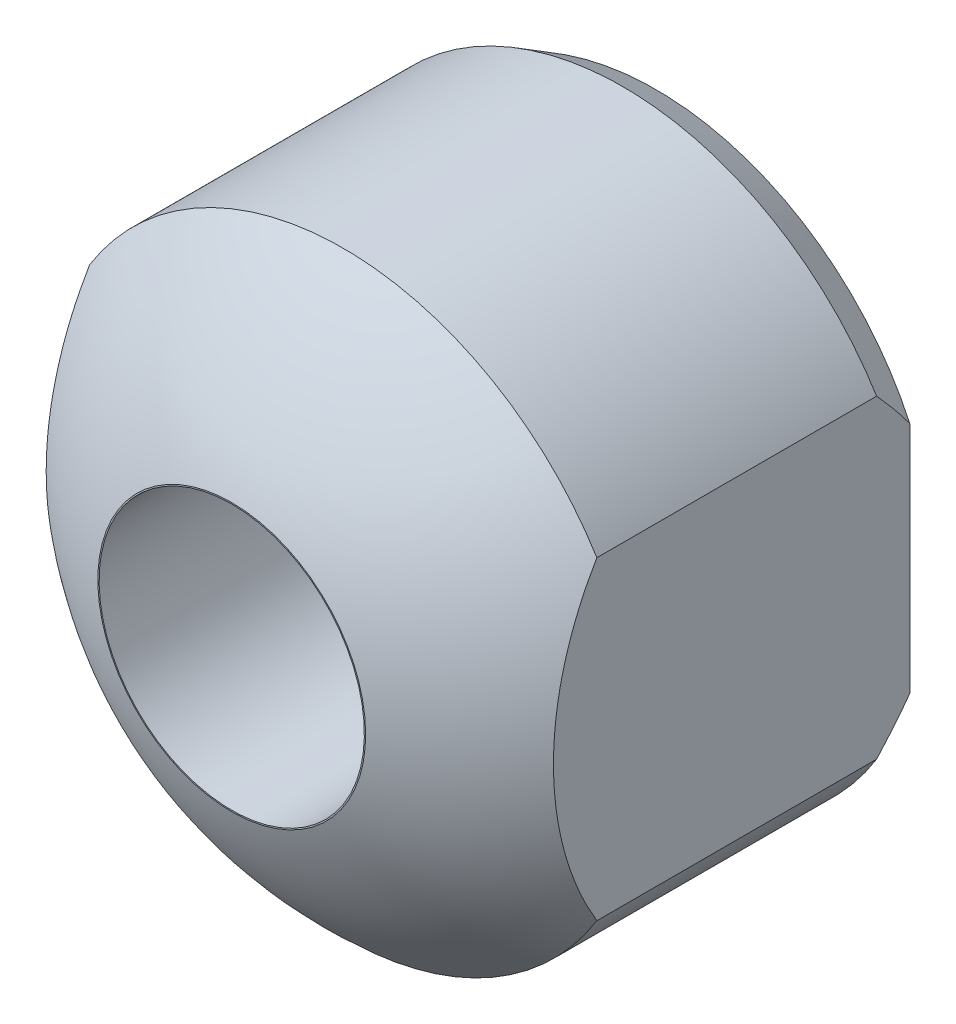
ISO-10303-21;
HEADER;
FILE_DESCRIPTION(('STEP AP214'),'2;1');
FILE_NAME('part.step','',(''),(''),'','','');
FILE_SCHEMA(('AUTOMOTIVE_DESIGN { 1 0 10303 214 1 1 1 1 }'));
ENDSEC;
DATA;
#1=APPLICATION_CONTEXT('core data for automotive mechanical design processes');
#2=APPLICATION_PROTOCOL_DEFINITION('international standard','automotive_design',2000,#1);
#3=PRODUCT_CONTEXT('',#1,'mechanical');
#4=PRODUCT('Part','Part','',(#3));
#5=PRODUCT_RELATED_PRODUCT_CATEGORY('part','',(#4));
#6=PRODUCT_DEFINITION_FORMATION('','',#4);
#7=PRODUCT_DEFINITION_CONTEXT('part definition',#1,'design');
#8=PRODUCT_DEFINITION('design','',#6,#7);
#9=PRODUCT_DEFINITION_SHAPE('','',#8);
#10=(LENGTH_UNIT() NAMED_UNIT(*) SI_UNIT(.MILLI.,.METRE.));
#11=(NAMED_UNIT(*) PLANE_ANGLE_UNIT() SI_UNIT($,.RADIAN.));
#12=(NAMED_UNIT(*) SI_UNIT($,.STERADIAN.) SOLID_ANGLE_UNIT());
#13=UNCERTAINTY_MEASURE_WITH_UNIT(LENGTH_MEASURE(1.E-05),#10,'distance_accuracy_value','');
#14=(GEOMETRIC_REPRESENTATION_CONTEXT(3) GLOBAL_UNCERTAINTY_ASSIGNED_CONTEXT((#13)) GLOBAL_UNIT_ASSIGNED_CONTEXT((#10,
#11,#12)) REPRESENTATION_CONTEXT('',''));
#15=CARTESIAN_POINT('',(0.,0.,0.));
#16=DIRECTION('',(0.,0.,1.));
#17=DIRECTION('',(1.,0.,0.));
#18=AXIS2_PLACEMENT_3D('',#15,#16,#17);
#19=CARTESIAN_POINT('',(-3.16240089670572E-12,0.,1.50000000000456));
#20=DIRECTION('',(0.,0.,1.));
#21=DIRECTION('',(-1.,0.,0.));
#22=AXIS2_PLACEMENT_3D('',#19,#20,#21);
#23=SPHERICAL_SURFACE('',#22,11.9999999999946);
#24=CARTESIAN_POINT('',(0.,0.,12.8));
#25=DIRECTION('',(0.,0.,1.));
#26=DIRECTION('',(0.,1.,0.));
#27=AXIS2_PLACEMENT_3D('',#24,#25,#26);
#28=CIRCLE('',#27,4.0385641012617);
#29=CARTESIAN_POINT('',(0.,4.0385641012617,12.8));
#30=VERTEX_POINT('',#29);
#31=EDGE_CURVE('E9',#30,#30,#28,.T.);
#32=ORIENTED_EDGE('',*,*,#31,.F.);
#33=EDGE_LOOP('',(#32));
#34=FACE_BOUND('',#33,.T.);
#35=CARTESIAN_POINT('',(7.65,0.,1.50000000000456));
#36=DIRECTION('',(-1.,0.,0.));
#37=DIRECTION('',(0.,-1.,0.));
#38=AXIS2_PLACEMENT_3D('',#35,#36,#37);
#39=CIRCLE('',#38,9.2454042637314);
#40=CARTESIAN_POINT('',(7.65,4.74104418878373,9.4372539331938));
#41=VERTEX_POINT('',#40);
#42=CARTESIAN_POINT('',(7.65,-4.74104418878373,9.4372539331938));
#43=VERTEX_POINT('',#42);
#44=EDGE_CURVE('E104',#41,#43,#39,.F.);
#45=ORIENTED_EDGE('',*,*,#44,.F.);
#46=CARTESIAN_POINT('',(0.,0.,9.4372539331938));
#47=DIRECTION('',(0.,0.,1.));
#48=DIRECTION('',(0.,1.,0.));
#49=AXIS2_PLACEMENT_3D('',#46,#47,#48);
#50=CIRCLE('',#49,9.);
#51=CARTESIAN_POINT('',(-7.65,4.74104418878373,9.4372539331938));
#52=VERTEX_POINT('',#51);
#53=EDGE_CURVE('E99',#41,#52,#50,.T.);
#54=ORIENTED_EDGE('',*,*,#53,.T.);
#55=CARTESIAN_POINT('',(-7.65,0.,1.50000000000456));
#56=DIRECTION('',(1.,0.,0.));
#57=DIRECTION('',(0.,1.,0.));
#58=AXIS2_PLACEMENT_3D('',#55,#56,#57);
#59=CIRCLE('',#58,9.24540426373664);
#60=CARTESIAN_POINT('',(-7.65,-4.74104418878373,9.4372539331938));
#61=VERTEX_POINT('',#60);
#62=EDGE_CURVE('E92',#61,#52,#59,.F.);
#63=ORIENTED_EDGE('',*,*,#62,.F.);
#64=EDGE_CURVE('E22',#61,#43,#50,.T.);
#65=ORIENTED_EDGE('',*,*,#64,.T.);
#66=EDGE_LOOP('',(#45,#54,#63,#65));
#67=FACE_BOUND('',#66,.T.);
#68=ADVANCED_FACE('F14',(#34,#67),#23,.T.);
#69=CARTESIAN_POINT('',(0.,0.,0.));
#70=DIRECTION('',(0.,0.,1.));
#71=DIRECTION('',(0.,1.,0.));
#72=AXIS2_PLACEMENT_3D('',#69,#70,#71);
#73=CYLINDRICAL_SURFACE('',#72,9.);
#74=ORIENTED_EDGE('',*,*,#53,.F.);
#75=DIRECTION('',(0.,0.,1.));
#76=VECTOR('',#75,1.);
#77=CARTESIAN_POINT('',(7.65,4.74104418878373,0.));
#78=LINE('',#77,#76);
#79=CARTESIAN_POINT('',(7.65,4.74104418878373,1.));
#80=VERTEX_POINT('',#79);
#81=EDGE_CURVE('E77',#41,#80,#78,.F.);
#82=ORIENTED_EDGE('',*,*,#81,.T.);
#83=CARTESIAN_POINT('',(0.,0.,1.));
#84=DIRECTION('',(0.,0.,1.));
#85=DIRECTION('',(0.,1.,0.));
#86=AXIS2_PLACEMENT_3D('',#83,#84,#85);
#87=CIRCLE('',#86,9.);
#88=CARTESIAN_POINT('',(-7.65,4.74104418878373,1.));
#89=VERTEX_POINT('',#88);
#90=EDGE_CURVE('E85',#80,#89,#87,.T.);
#91=ORIENTED_EDGE('',*,*,#90,.T.);
#92=DIRECTION('',(0.,0.,1.));
#93=VECTOR('',#92,1.);
#94=CARTESIAN_POINT('',(-7.65,4.74104418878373,0.));
#95=LINE('',#94,#93);
#96=EDGE_CURVE('E109',#89,#52,#95,.T.);
#97=ORIENTED_EDGE('',*,*,#96,.T.);
#98=EDGE_LOOP('',(#74,#82,#91,#97));
#99=FACE_BOUND('',#98,.T.);
#100=ADVANCED_FACE('F110',(#99),#73,.T.);
#101=CARTESIAN_POINT('',(0.,0.,1.));
#102=DIRECTION('',(0.,0.,1.));
#103=DIRECTION('',(0.,1.,0.));
#104=AXIS2_PLACEMENT_3D('',#101,#102,#103);
#105=CONICAL_SURFACE('',#104,9.,0.523598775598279);
#106=ORIENTED_EDGE('',*,*,#90,.F.);
#107=CARTESIAN_POINT('',(7.65,9.42253132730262,6.43343108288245));
#108=CARTESIAN_POINT('',(7.65,9.26459441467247,6.22107932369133));
#109=CARTESIAN_POINT('',(7.65,9.105659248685,6.00946402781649));
#110=CARTESIAN_POINT('',(7.65,8.78547000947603,5.58797021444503));
#111=CARTESIAN_POINT('',(7.65,8.62421575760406,5.37809183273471));
#112=CARTESIAN_POINT('',(7.65,8.29877391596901,4.95996216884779));
#113=CARTESIAN_POINT('',(7.65,8.13458122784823,4.75171484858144));
#114=CARTESIAN_POINT('',(7.65,7.80318382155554,4.337635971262));
#115=CARTESIAN_POINT('',(7.65,7.63597917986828,4.13180435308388));
#116=CARTESIAN_POINT('',(7.65,7.29712178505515,3.72184297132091));
#117=CARTESIAN_POINT('',(7.65,7.12544904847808,3.51772969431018));
#118=CARTESIAN_POINT('',(7.65,6.77801179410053,3.11301794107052));
#119=CARTESIAN_POINT('',(7.65,6.60224740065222,2.91241935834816));
#120=CARTESIAN_POINT('',(7.65,6.24604509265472,2.51566372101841));
#121=CARTESIAN_POINT('',(7.65,6.06561062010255,2.31950358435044));
#122=CARTESIAN_POINT('',(7.65,5.6991017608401,1.93254196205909));
#123=CARTESIAN_POINT('',(7.65,5.51302803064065,1.74173985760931));
#124=CARTESIAN_POINT('',(7.65,5.17174466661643,1.40409645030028));
#125=CARTESIAN_POINT('',(7.65,5.01773591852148,1.25604377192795));
#126=CARTESIAN_POINT('',(7.65,4.70472636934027,0.965271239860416));
#127=CARTESIAN_POINT('',(7.65,4.54572528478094,0.822551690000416));
#128=CARTESIAN_POINT('',(7.65,4.22147979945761,0.543317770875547));
#129=CARTESIAN_POINT('',(7.65,4.05621765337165,0.406823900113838));
#130=CARTESIAN_POINT('',(7.65,3.71904801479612,0.142247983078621));
#131=CARTESIAN_POINT('',(7.65,3.54714051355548,0.0141659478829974));
#132=CARTESIAN_POINT('',(7.65,3.19265334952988,-0.233448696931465));
#133=CARTESIAN_POINT('',(7.65,3.00993857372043,-0.352789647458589));
#134=CARTESIAN_POINT('',(7.65,2.63574467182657,-0.577156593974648));
#135=CARTESIAN_POINT('',(7.65,2.44426315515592,-0.682178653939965));
#136=CARTESIAN_POINT('',(7.65,2.05335497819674,-0.873083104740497));
#137=CARTESIAN_POINT('',(7.65,1.85398591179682,-0.959081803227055));
#138=CARTESIAN_POINT('',(7.65,1.44676520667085,-1.10778159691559));
#139=CARTESIAN_POINT('',(7.65,1.23892389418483,-1.17051016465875));
#140=CARTESIAN_POINT('',(7.65,0.901111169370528,-1.24844246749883));
#141=CARTESIAN_POINT('',(7.65,0.77318041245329,-1.2726215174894));
#142=CARTESIAN_POINT('',(7.65,0.515743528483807,-1.31004599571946));
#143=CARTESIAN_POINT('',(7.65,0.386237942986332,-1.32329508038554));
#144=CARTESIAN_POINT('',(7.65,0.126564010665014,-1.33836163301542));
#145=CARTESIAN_POINT('',(7.65,-0.00360431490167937,-1.34017946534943));
#146=CARTESIAN_POINT('',(7.65,-0.263594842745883,-1.33231683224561));
#147=CARTESIAN_POINT('',(7.65,-0.393417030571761,-1.32263589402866));
#148=CARTESIAN_POINT('',(7.65,-0.651217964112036,-1.29220443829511));
#149=CARTESIAN_POINT('',(7.65,-0.779202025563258,-1.27149861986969));
#150=CARTESIAN_POINT('',(7.65,-1.03308919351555,-1.21977936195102));
#151=CARTESIAN_POINT('',(7.65,-1.15899140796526,-1.18876161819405));
#152=CARTESIAN_POINT('',(7.65,-1.53283906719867,-1.081596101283));
#153=CARTESIAN_POINT('',(7.65,-1.77680912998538,-0.991351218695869));
#154=CARTESIAN_POINT('',(7.65,-2.22586360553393,-0.793366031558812));
#155=CARTESIAN_POINT('',(7.65,-2.4323004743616,-0.688571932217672));
#156=CARTESIAN_POINT('',(7.65,-2.83535439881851,-0.461309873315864));
#157=CARTESIAN_POINT('',(7.65,-3.03196241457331,-0.338826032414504));
#158=CARTESIAN_POINT('',(7.65,-3.41682302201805,-0.0799505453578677));
#159=CARTESIAN_POINT('',(7.65,-3.60503906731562,0.0564947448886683));
#160=CARTESIAN_POINT('',(7.65,-3.97338703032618,0.339680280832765));
#161=CARTESIAN_POINT('',(7.65,-4.15352177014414,0.486416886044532));
#162=CARTESIAN_POINT('',(7.65,-4.52217214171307,0.800950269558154));
#163=CARTESIAN_POINT('',(7.65,-4.71006699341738,0.969471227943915));
#164=CARTESIAN_POINT('',(7.65,-4.98594182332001,1.22699792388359));
#165=CARTESIAN_POINT('',(7.65,-5.07652438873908,1.31324584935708));
#166=CARTESIAN_POINT('',(7.65,-5.25611862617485,1.48734006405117));
#167=CARTESIAN_POINT('',(7.65,-5.34513049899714,1.57518614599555));
#168=CARTESIAN_POINT('',(7.65,-5.43343108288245,1.66374319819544));
#169=B_SPLINE_CURVE_WITH_KNOTS('',3,(#107,#108,#109,#110,#111,#112,#113,#114,#115,#116,#117,
#118,#119,#120,#121,#122,#123,#124,#125,#126,#127,#128,#129,#130,#131,#132,#133,#134,#135,#136,
#137,#138,#139,#140,#141,#142,#143,#144,#145,#146,#147,#148,#149,#150,#151,#152,#153,#154,#155,
#156,#157,#158,#159,#160,#161,#162,#163,#164,#165,#166,#167,#168),.UNSPECIFIED.,.F.,.F.,(4,2,2,
2,2,2,2,2,2,2,2,2,2,2,2,2,2,2,2,2,2,2,2,2,2,2,2,2,2,2,4),(0.,0.793941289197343,1.58794407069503,
2.38349223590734,3.17902022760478,3.97910206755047,4.77915962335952,5.57864342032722,
6.37803449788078,7.01882668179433,7.65965531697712,8.30246065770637,8.94526684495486,
9.59946089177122,10.2538344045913,10.9040891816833,11.5535738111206,11.9437502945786,
12.3337961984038,12.7238296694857,13.1138791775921,13.5023591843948,13.8910015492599,
14.6686345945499,15.3621974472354,16.0563868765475,16.7533515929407,17.450070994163,
18.2069927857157,18.582204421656,18.9573677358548),.UNSPECIFIED.);
#170=CARTESIAN_POINT('',(7.65,3.5239932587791,0.));
#171=VERTEX_POINT('',#170);
#172=EDGE_CURVE('E69',#80,#171,#169,.T.);
#173=ORIENTED_EDGE('',*,*,#172,.T.);
#174=CARTESIAN_POINT('',(0.,0.,0.));
#175=DIRECTION('',(0.,0.,1.));
#176=DIRECTION('',(0.,1.,0.));
#177=AXIS2_PLACEMENT_3D('',#174,#175,#176);
#178=CIRCLE('',#177,8.4226497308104);
#179=CARTESIAN_POINT('',(-7.65,3.52399325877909,0.));
#180=VERTEX_POINT('',#179);
#181=EDGE_CURVE('E83',#171,#180,#178,.T.);
#182=ORIENTED_EDGE('',*,*,#181,.T.);
#183=CARTESIAN_POINT('',(-7.65,-5.43343108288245,1.66374319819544));
#184=CARTESIAN_POINT('',(-7.65,-5.33180749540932,1.5618317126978));
#185=CARTESIAN_POINT('',(-7.65,-5.22924110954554,1.46085013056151));
#186=CARTESIAN_POINT('',(-7.65,-5.02199570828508,1.26103732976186));
#187=CARTESIAN_POINT('',(-7.65,-4.9173162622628,1.1622065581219));
#188=CARTESIAN_POINT('',(-7.65,-4.70519491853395,0.966599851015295));
#189=CARTESIAN_POINT('',(-7.65,-4.59774291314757,0.869834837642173));
#190=CARTESIAN_POINT('',(-7.65,-4.38029435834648,0.679224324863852));
#191=CARTESIAN_POINT('',(-7.65,-4.27029795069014,0.585378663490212));
#192=CARTESIAN_POINT('',(-7.65,-3.9298810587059,0.303740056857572));
#193=CARTESIAN_POINT('',(-7.65,-3.69491845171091,0.121356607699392));
#194=CARTESIAN_POINT('',(-7.65,-3.21108453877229,-0.223391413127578));
#195=CARTESIAN_POINT('',(-7.65,-2.96224019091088,-0.385792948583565));
#196=CARTESIAN_POINT('',(-7.65,-2.57789643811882,-0.607718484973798));
#197=CARTESIAN_POINT('',(-7.65,-2.44850188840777,-0.677831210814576));
#198=CARTESIAN_POINT('',(-7.65,-2.18554588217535,-0.809858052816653));
#199=CARTESIAN_POINT('',(-7.65,-2.05198410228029,-0.871771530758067));
#200=CARTESIAN_POINT('',(-7.65,-1.78154787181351,-0.985591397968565));
#201=CARTESIAN_POINT('',(-7.65,-1.64469728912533,-1.03755405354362));
#202=CARTESIAN_POINT('',(-7.65,-1.3672851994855,-1.13035984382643));
#203=CARTESIAN_POINT('',(-7.65,-1.22672480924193,-1.17120628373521));
#204=CARTESIAN_POINT('',(-7.65,-0.940138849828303,-1.24088283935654));
#205=CARTESIAN_POINT('',(-7.65,-0.794061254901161,-1.26950161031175));
#206=CARTESIAN_POINT('',(-7.65,-0.499804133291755,-1.31244605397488));
#207=CARTESIAN_POINT('',(-7.65,-0.351624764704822,-1.32677279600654));
#208=CARTESIAN_POINT('',(-7.65,-0.0545835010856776,-1.34042624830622));
#209=CARTESIAN_POINT('',(-7.65,0.0942783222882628,-1.33975449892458));
#210=CARTESIAN_POINT('',(-7.65,0.391169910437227,-1.32344698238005));
#211=CARTESIAN_POINT('',(-7.65,0.539199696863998,-1.30781160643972));
#212=CARTESIAN_POINT('',(-7.65,0.812007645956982,-1.2656071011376));
#213=CARTESIAN_POINT('',(-7.65,0.937083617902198,-1.24092131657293));
#214=CARTESIAN_POINT('',(-7.65,1.18496753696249,-1.18194112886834));
#215=CARTESIAN_POINT('',(-7.65,1.30777466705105,-1.14764333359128));
#216=CARTESIAN_POINT('',(-7.65,1.67206409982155,-1.03175694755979));
#217=CARTESIAN_POINT('',(-7.65,1.90946078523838,-0.93716758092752));
#218=CARTESIAN_POINT('',(-7.65,2.36077045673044,-0.726579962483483));
#219=CARTESIAN_POINT('',(-7.65,2.57526198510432,-0.611778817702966));
#220=CARTESIAN_POINT('',(-7.65,2.99359602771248,-0.363955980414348));
#221=CARTESIAN_POINT('',(-7.65,3.19742821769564,-0.230917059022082));
#222=CARTESIAN_POINT('',(-7.65,3.59723628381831,0.0500779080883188));
#223=CARTESIAN_POINT('',(-7.65,3.79312218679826,0.198160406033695));
#224=CARTESIAN_POINT('',(-7.65,4.17631694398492,0.504782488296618));
#225=CARTESIAN_POINT('',(-7.65,4.36362949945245,0.663317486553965));
#226=CARTESIAN_POINT('',(-7.65,4.78558515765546,1.03674480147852));
#227=CARTESIAN_POINT('',(-7.65,5.01777412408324,1.25439773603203));
#228=CARTESIAN_POINT('',(-7.65,5.47241083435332,1.69969987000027));
#229=CARTESIAN_POINT('',(-7.65,5.69485543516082,1.92735224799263));
#230=CARTESIAN_POINT('',(-7.65,6.13215934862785,2.39058111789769));
#231=CARTESIAN_POINT('',(-7.65,6.34700409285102,2.62617129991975));
#232=CARTESIAN_POINT('',(-7.65,6.77012798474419,3.10318096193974));
#233=CARTESIAN_POINT('',(-7.65,6.97840667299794,3.34460084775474));
#234=CARTESIAN_POINT('',(-7.65,7.37893217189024,3.8194993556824));
#235=CARTESIAN_POINT('',(-7.65,7.57145262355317,4.0527479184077));
#236=CARTESIAN_POINT('',(-7.65,7.95234498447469,4.52262060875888));
#237=CARTESIAN_POINT('',(-7.65,8.14071669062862,4.75924490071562));
#238=CARTESIAN_POINT('',(-7.65,8.51306135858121,5.23417333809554));
#239=CARTESIAN_POINT('',(-7.65,8.69705053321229,5.47246480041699));
#240=CARTESIAN_POINT('',(-7.65,9.06196463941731,5.95133321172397));
#241=CARTESIAN_POINT('',(-7.65,9.24288998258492,6.19190984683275));
#242=CARTESIAN_POINT('',(-7.65,9.42253132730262,6.43343108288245));
#243=B_SPLINE_CURVE_WITH_KNOTS('',3,(#183,#184,#185,#186,#187,#188,#189,#190,#191,#192,#193,
#194,#195,#196,#197,#198,#199,#200,#201,#202,#203,#204,#205,#206,#207,#208,#209,#210,#211,#212,
#213,#214,#215,#216,#217,#218,#219,#220,#221,#222,#223,#224,#225,#226,#227,#228,#229,#230,#231,
#232,#233,#234,#235,#236,#237,#238,#239,#240,#241,#242),.UNSPECIFIED.,.F.,.F.,(4,2,2,2,2,2,2,2,
2,2,2,2,2,2,2,2,2,2,2,2,2,2,2,2,2,2,2,2,2,4),(0.,0.431767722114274,0.863624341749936,
1.29737632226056,1.73110419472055,2.62271200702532,3.51264484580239,3.95392042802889,
4.39523033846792,4.8339660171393,5.27257110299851,5.71847730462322,6.1643501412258,
6.61017718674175,7.05599257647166,7.43805375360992,7.82024993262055,8.58450271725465,
9.31329195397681,10.0427744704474,10.7789960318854,11.5148966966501,12.4692292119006,
13.4238673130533,14.3802458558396,15.3366911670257,16.2439514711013,17.1512560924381,
18.0543991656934,18.9574199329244),.UNSPECIFIED.);
#244=EDGE_CURVE('E111',#180,#89,#243,.T.);
#245=ORIENTED_EDGE('',*,*,#244,.T.);
#246=EDGE_LOOP('',(#106,#173,#182,#245));
#247=FACE_BOUND('',#246,.T.);
#248=ADVANCED_FACE('F81',(#247),#105,.T.);
#249=CARTESIAN_POINT('',(-8.4226497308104,0.,0.));
#250=DIRECTION('',(0.,0.,-1.));
#251=DIRECTION('',(0.,-1.,0.));
#252=AXIS2_PLACEMENT_3D('',#249,#250,#251);
#253=PLANE('',#252);
#254=CARTESIAN_POINT('',(0.,0.,0.));
#255=DIRECTION('',(0.,0.,1.));
#256=DIRECTION('',(0.,1.,0.));
#257=AXIS2_PLACEMENT_3D('',#254,#255,#256);
#258=CIRCLE('',#257,4.);
#259=CARTESIAN_POINT('',(0.,4.,0.));
#260=VERTEX_POINT('',#259);
#261=EDGE_CURVE('E162',#260,#260,#258,.T.);
#262=ORIENTED_EDGE('',*,*,#261,.T.);
#263=EDGE_LOOP('',(#262));
#264=FACE_BOUND('',#263,.T.);
#265=ORIENTED_EDGE('',*,*,#181,.F.);
#266=DIRECTION('',(0.,1.,0.));
#267=VECTOR('',#266,1.);
#268=CARTESIAN_POINT('',(7.65,-9.,0.));
#269=LINE('',#268,#267);
#270=CARTESIAN_POINT('',(7.65,-3.5239932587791,0.));
#271=VERTEX_POINT('',#270);
#272=EDGE_CURVE('E65',#271,#171,#269,.T.);
#273=ORIENTED_EDGE('',*,*,#272,.F.);
#274=CARTESIAN_POINT('',(-7.65,-3.52399325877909,0.));
#275=VERTEX_POINT('',#274);
#276=EDGE_CURVE('E91',#275,#271,#178,.T.);
#277=ORIENTED_EDGE('',*,*,#276,.F.);
#278=DIRECTION('',(0.,1.,0.));
#279=VECTOR('',#278,1.);
#280=CARTESIAN_POINT('',(-7.65,-9.,0.));
#281=LINE('',#280,#279);
#282=EDGE_CURVE('E89',#275,#180,#281,.T.);
#283=ORIENTED_EDGE('',*,*,#282,.T.);
#284=EDGE_LOOP('',(#265,#273,#277,#283));
#285=FACE_BOUND('',#284,.T.);
#286=ADVANCED_FACE('F88',(#264,#285),#253,.T.);
#287=DIRECTION('',(0.,0.,1.));
#288=VECTOR('',#287,1.);
#289=CARTESIAN_POINT('',(7.65,-4.74104418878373,0.));
#290=LINE('',#289,#288);
#291=CARTESIAN_POINT('',(7.65,-4.74104418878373,1.));
#292=VERTEX_POINT('',#291);
#293=EDGE_CURVE('E182',#43,#292,#290,.F.);
#294=ORIENTED_EDGE('',*,*,#293,.F.);
#295=ORIENTED_EDGE('',*,*,#64,.F.);
#296=DIRECTION('',(0.,0.,1.));
#297=VECTOR('',#296,1.);
#298=CARTESIAN_POINT('',(-7.65,-4.74104418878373,0.));
#299=LINE('',#298,#297);
#300=CARTESIAN_POINT('',(-7.65,-4.74104418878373,1.));
#301=VERTEX_POINT('',#300);
#302=EDGE_CURVE('E29',#301,#61,#299,.T.);
#303=ORIENTED_EDGE('',*,*,#302,.F.);
#304=EDGE_CURVE('E97',#301,#292,#87,.T.);
#305=ORIENTED_EDGE('',*,*,#304,.T.);
#306=EDGE_LOOP('',(#294,#295,#303,#305));
#307=FACE_BOUND('',#306,.T.);
#308=ADVANCED_FACE('F136',(#307),#73,.T.);
#309=CARTESIAN_POINT('',(7.65,-9.42253132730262,6.43343108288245));
#310=CARTESIAN_POINT('',(7.65,-9.26459441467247,6.22107932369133));
#311=CARTESIAN_POINT('',(7.65,-9.105659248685,6.00946402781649));
#312=CARTESIAN_POINT('',(7.65,-8.78547000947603,5.58797021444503));
#313=CARTESIAN_POINT('',(7.65,-8.62421575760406,5.37809183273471));
#314=CARTESIAN_POINT('',(7.65,-8.29877391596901,4.95996216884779));
#315=CARTESIAN_POINT('',(7.65,-8.13458122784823,4.75171484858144));
#316=CARTESIAN_POINT('',(7.65,-7.80318382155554,4.337635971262));
#317=CARTESIAN_POINT('',(7.65,-7.63597917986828,4.13180435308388));
#318=CARTESIAN_POINT('',(7.65,-7.29712178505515,3.72184297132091));
#319=CARTESIAN_POINT('',(7.65,-7.12544904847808,3.51772969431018));
#320=CARTESIAN_POINT('',(7.65,-6.77801179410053,3.11301794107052));
#321=CARTESIAN_POINT('',(7.65,-6.60224740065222,2.91241935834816));
#322=CARTESIAN_POINT('',(7.65,-6.24604509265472,2.51566372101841));
#323=CARTESIAN_POINT('',(7.65,-6.06561062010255,2.31950358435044));
#324=CARTESIAN_POINT('',(7.65,-5.6991017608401,1.93254196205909));
#325=CARTESIAN_POINT('',(7.65,-5.51302803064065,1.74173985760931));
#326=CARTESIAN_POINT('',(7.65,-5.17174466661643,1.40409645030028));
#327=CARTESIAN_POINT('',(7.65,-5.01773591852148,1.25604377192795));
#328=CARTESIAN_POINT('',(7.65,-4.70472636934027,0.965271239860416));
#329=CARTESIAN_POINT('',(7.65,-4.54572528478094,0.822551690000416));
#330=CARTESIAN_POINT('',(7.65,-4.22147979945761,0.543317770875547));
#331=CARTESIAN_POINT('',(7.65,-4.05621765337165,0.406823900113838));
#332=CARTESIAN_POINT('',(7.65,-3.71904801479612,0.142247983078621));
#333=CARTESIAN_POINT('',(7.65,-3.54714051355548,0.0141659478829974));
#334=CARTESIAN_POINT('',(7.65,-3.19265334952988,-0.233448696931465));
#335=CARTESIAN_POINT('',(7.65,-3.00993857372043,-0.352789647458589));
#336=CARTESIAN_POINT('',(7.65,-2.63574467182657,-0.577156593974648));
#337=CARTESIAN_POINT('',(7.65,-2.44426315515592,-0.682178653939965));
#338=CARTESIAN_POINT('',(7.65,-2.05335497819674,-0.873083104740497));
#339=CARTESIAN_POINT('',(7.65,-1.85398591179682,-0.959081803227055));
#340=CARTESIAN_POINT('',(7.65,-1.44676520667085,-1.10778159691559));
#341=CARTESIAN_POINT('',(7.65,-1.23892389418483,-1.17051016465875));
#342=CARTESIAN_POINT('',(7.65,-0.901111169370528,-1.24844246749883));
#343=CARTESIAN_POINT('',(7.65,-0.77318041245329,-1.2726215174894));
#344=CARTESIAN_POINT('',(7.65,-0.515743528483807,-1.31004599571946));
#345=CARTESIAN_POINT('',(7.65,-0.386237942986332,-1.32329508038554));
#346=CARTESIAN_POINT('',(7.65,-0.126564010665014,-1.33836163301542));
#347=CARTESIAN_POINT('',(7.65,0.00360431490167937,-1.34017946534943));
#348=CARTESIAN_POINT('',(7.65,0.263594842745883,-1.33231683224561));
#349=CARTESIAN_POINT('',(7.65,0.393417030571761,-1.32263589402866));
#350=CARTESIAN_POINT('',(7.65,0.651217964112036,-1.29220443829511));
#351=CARTESIAN_POINT('',(7.65,0.779202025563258,-1.27149861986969));
#352=CARTESIAN_POINT('',(7.65,1.03308919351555,-1.21977936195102));
#353=CARTESIAN_POINT('',(7.65,1.15899140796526,-1.18876161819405));
#354=CARTESIAN_POINT('',(7.65,1.53283906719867,-1.081596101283));
#355=CARTESIAN_POINT('',(7.65,1.77680912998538,-0.991351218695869));
#356=CARTESIAN_POINT('',(7.65,2.22586360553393,-0.793366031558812));
#357=CARTESIAN_POINT('',(7.65,2.4323004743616,-0.688571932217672));
#358=CARTESIAN_POINT('',(7.65,2.83535439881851,-0.461309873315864));
#359=CARTESIAN_POINT('',(7.65,3.03196241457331,-0.338826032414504));
#360=CARTESIAN_POINT('',(7.65,3.41682302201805,-0.0799505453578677));
#361=CARTESIAN_POINT('',(7.65,3.60503906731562,0.0564947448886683));
#362=CARTESIAN_POINT('',(7.65,3.97338703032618,0.339680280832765));
#363=CARTESIAN_POINT('',(7.65,4.15352177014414,0.486416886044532));
#364=CARTESIAN_POINT('',(7.65,4.52217214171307,0.800950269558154));
#365=CARTESIAN_POINT('',(7.65,4.71006699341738,0.969471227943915));
#366=CARTESIAN_POINT('',(7.65,4.98594182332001,1.22699792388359));
#367=CARTESIAN_POINT('',(7.65,5.07652438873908,1.31324584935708));
#368=CARTESIAN_POINT('',(7.65,5.25611862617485,1.48734006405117));
#369=CARTESIAN_POINT('',(7.65,5.34513049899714,1.57518614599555));
#370=CARTESIAN_POINT('',(7.65,5.43343108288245,1.66374319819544));
#371=B_SPLINE_CURVE_WITH_KNOTS('',3,(#309,#310,#311,#312,#313,#314,#315,#316,#317,#318,#319,
#320,#321,#322,#323,#324,#325,#326,#327,#328,#329,#330,#331,#332,#333,#334,#335,#336,#337,#338,
#339,#340,#341,#342,#343,#344,#345,#346,#347,#348,#349,#350,#351,#352,#353,#354,#355,#356,#357,
#358,#359,#360,#361,#362,#363,#364,#365,#366,#367,#368,#369,#370),.UNSPECIFIED.,.F.,.F.,(4,2,2,
2,2,2,2,2,2,2,2,2,2,2,2,2,2,2,2,2,2,2,2,2,2,2,2,2,2,2,4),(0.,0.793941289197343,1.58794407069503,
2.38349223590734,3.17902022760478,3.97910206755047,4.77915962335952,5.57864342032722,
6.37803449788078,7.01882668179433,7.65965531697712,8.30246065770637,8.94526684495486,
9.59946089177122,10.2538344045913,10.9040891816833,11.5535738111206,11.9437502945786,
12.3337961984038,12.7238296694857,13.1138791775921,13.5023591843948,13.8910015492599,
14.6686345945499,15.3621974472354,16.0563868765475,16.7533515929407,17.450070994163,
18.2069927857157,18.582204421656,18.9573677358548),.UNSPECIFIED.);
#372=EDGE_CURVE('E72',#292,#271,#371,.T.);
#373=ORIENTED_EDGE('',*,*,#372,.F.);
#374=ORIENTED_EDGE('',*,*,#304,.F.);
#375=CARTESIAN_POINT('',(-7.65,5.43343108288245,1.66374319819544));
#376=CARTESIAN_POINT('',(-7.65,5.33180749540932,1.5618317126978));
#377=CARTESIAN_POINT('',(-7.65,5.22924110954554,1.46085013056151));
#378=CARTESIAN_POINT('',(-7.65,5.02199570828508,1.26103732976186));
#379=CARTESIAN_POINT('',(-7.65,4.9173162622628,1.1622065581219));
#380=CARTESIAN_POINT('',(-7.65,4.70519491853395,0.966599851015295));
#381=CARTESIAN_POINT('',(-7.65,4.59774291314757,0.869834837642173));
#382=CARTESIAN_POINT('',(-7.65,4.38029435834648,0.679224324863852));
#383=CARTESIAN_POINT('',(-7.65,4.27029795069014,0.585378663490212));
#384=CARTESIAN_POINT('',(-7.65,3.9298810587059,0.303740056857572));
#385=CARTESIAN_POINT('',(-7.65,3.69491845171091,0.121356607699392));
#386=CARTESIAN_POINT('',(-7.65,3.21108453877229,-0.223391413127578));
#387=CARTESIAN_POINT('',(-7.65,2.96224019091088,-0.385792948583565));
#388=CARTESIAN_POINT('',(-7.65,2.57789643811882,-0.607718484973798));
#389=CARTESIAN_POINT('',(-7.65,2.44850188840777,-0.677831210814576));
#390=CARTESIAN_POINT('',(-7.65,2.18554588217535,-0.809858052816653));
#391=CARTESIAN_POINT('',(-7.65,2.05198410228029,-0.871771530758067));
#392=CARTESIAN_POINT('',(-7.65,1.78154787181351,-0.985591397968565));
#393=CARTESIAN_POINT('',(-7.65,1.64469728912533,-1.03755405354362));
#394=CARTESIAN_POINT('',(-7.65,1.3672851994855,-1.13035984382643));
#395=CARTESIAN_POINT('',(-7.65,1.22672480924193,-1.17120628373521));
#396=CARTESIAN_POINT('',(-7.65,0.940138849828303,-1.24088283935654));
#397=CARTESIAN_POINT('',(-7.65,0.794061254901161,-1.26950161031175));
#398=CARTESIAN_POINT('',(-7.65,0.499804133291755,-1.31244605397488));
#399=CARTESIAN_POINT('',(-7.65,0.351624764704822,-1.32677279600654));
#400=CARTESIAN_POINT('',(-7.65,0.0545835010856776,-1.34042624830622));
#401=CARTESIAN_POINT('',(-7.65,-0.0942783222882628,-1.33975449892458));
#402=CARTESIAN_POINT('',(-7.65,-0.391169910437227,-1.32344698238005));
#403=CARTESIAN_POINT('',(-7.65,-0.539199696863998,-1.30781160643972));
#404=CARTESIAN_POINT('',(-7.65,-0.812007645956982,-1.2656071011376));
#405=CARTESIAN_POINT('',(-7.65,-0.937083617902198,-1.24092131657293));
#406=CARTESIAN_POINT('',(-7.65,-1.18496753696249,-1.18194112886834));
#407=CARTESIAN_POINT('',(-7.65,-1.30777466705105,-1.14764333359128));
#408=CARTESIAN_POINT('',(-7.65,-1.67206409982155,-1.03175694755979));
#409=CARTESIAN_POINT('',(-7.65,-1.90946078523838,-0.93716758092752));
#410=CARTESIAN_POINT('',(-7.65,-2.36077045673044,-0.726579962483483));
#411=CARTESIAN_POINT('',(-7.65,-2.57526198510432,-0.611778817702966));
#412=CARTESIAN_POINT('',(-7.65,-2.99359602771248,-0.363955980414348));
#413=CARTESIAN_POINT('',(-7.65,-3.19742821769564,-0.230917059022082));
#414=CARTESIAN_POINT('',(-7.65,-3.59723628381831,0.0500779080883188));
#415=CARTESIAN_POINT('',(-7.65,-3.79312218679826,0.198160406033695));
#416=CARTESIAN_POINT('',(-7.65,-4.17631694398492,0.504782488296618));
#417=CARTESIAN_POINT('',(-7.65,-4.36362949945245,0.663317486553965));
#418=CARTESIAN_POINT('',(-7.65,-4.78558515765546,1.03674480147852));
#419=CARTESIAN_POINT('',(-7.65,-5.01777412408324,1.25439773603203));
#420=CARTESIAN_POINT('',(-7.65,-5.47241083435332,1.69969987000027));
#421=CARTESIAN_POINT('',(-7.65,-5.69485543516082,1.92735224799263));
#422=CARTESIAN_POINT('',(-7.65,-6.13215934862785,2.39058111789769));
#423=CARTESIAN_POINT('',(-7.65,-6.34700409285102,2.62617129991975));
#424=CARTESIAN_POINT('',(-7.65,-6.77012798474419,3.10318096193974));
#425=CARTESIAN_POINT('',(-7.65,-6.97840667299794,3.34460084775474));
#426=CARTESIAN_POINT('',(-7.65,-7.37893217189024,3.8194993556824));
#427=CARTESIAN_POINT('',(-7.65,-7.57145262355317,4.0527479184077));
#428=CARTESIAN_POINT('',(-7.65,-7.95234498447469,4.52262060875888));
#429=CARTESIAN_POINT('',(-7.65,-8.14071669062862,4.75924490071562));
#430=CARTESIAN_POINT('',(-7.65,-8.51306135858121,5.23417333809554));
#431=CARTESIAN_POINT('',(-7.65,-8.69705053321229,5.47246480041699));
#432=CARTESIAN_POINT('',(-7.65,-9.06196463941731,5.95133321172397));
#433=CARTESIAN_POINT('',(-7.65,-9.24288998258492,6.19190984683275));
#434=CARTESIAN_POINT('',(-7.65,-9.42253132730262,6.43343108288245));
#435=B_SPLINE_CURVE_WITH_KNOTS('',3,(#375,#376,#377,#378,#379,#380,#381,#382,#383,#384,#385,
#386,#387,#388,#389,#390,#391,#392,#393,#394,#395,#396,#397,#398,#399,#400,#401,#402,#403,#404,
#405,#406,#407,#408,#409,#410,#411,#412,#413,#414,#415,#416,#417,#418,#419,#420,#421,#422,#423,
#424,#425,#426,#427,#428,#429,#430,#431,#432,#433,#434),.UNSPECIFIED.,.F.,.F.,(4,2,2,2,2,2,2,2,
2,2,2,2,2,2,2,2,2,2,2,2,2,2,2,2,2,2,2,2,2,4),(0.,0.431767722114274,0.863624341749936,
1.29737632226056,1.73110419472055,2.62271200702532,3.51264484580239,3.95392042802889,
4.39523033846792,4.8339660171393,5.27257110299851,5.71847730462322,6.1643501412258,
6.61017718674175,7.05599257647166,7.43805375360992,7.82024993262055,8.58450271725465,
9.31329195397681,10.0427744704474,10.7789960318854,11.5148966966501,12.4692292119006,
13.4238673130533,14.3802458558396,15.3366911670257,16.2439514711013,17.1512560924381,
18.0543991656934,18.9574199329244),.UNSPECIFIED.);
#436=EDGE_CURVE('E34',#275,#301,#435,.T.);
#437=ORIENTED_EDGE('',*,*,#436,.F.);
#438=ORIENTED_EDGE('',*,*,#276,.T.);
#439=EDGE_LOOP('',(#373,#374,#437,#438));
#440=FACE_BOUND('',#439,.T.);
#441=ADVANCED_FACE('F143',(#440),#105,.T.);
#442=CARTESIAN_POINT('',(0.,0.,12.8));
#443=DIRECTION('',(0.,0.,1.));
#444=DIRECTION('',(0.,1.,0.));
#445=AXIS2_PLACEMENT_3D('',#442,#443,#444);
#446=PLANE('',#445);
#447=CARTESIAN_POINT('',(0.,0.,12.8));
#448=DIRECTION('',(0.,0.,1.));
#449=DIRECTION('',(0.,1.,0.));
#450=AXIS2_PLACEMENT_3D('',#447,#448,#449);
#451=CIRCLE('',#450,4.);
#452=CARTESIAN_POINT('',(0.,4.,12.8));
#453=VERTEX_POINT('',#452);
#454=EDGE_CURVE('E86',#453,#453,#451,.T.);
#455=ORIENTED_EDGE('',*,*,#454,.F.);
#456=EDGE_LOOP('',(#455));
#457=FACE_BOUND('',#456,.T.);
#458=ORIENTED_EDGE('',*,*,#31,.T.);
#459=EDGE_LOOP('',(#458));
#460=FACE_BOUND('',#459,.T.);
#461=ADVANCED_FACE('F16',(#457,#460),#446,.T.);
#462=CARTESIAN_POINT('',(-7.65,-9.,12.8));
#463=DIRECTION('',(1.,0.,0.));
#464=DIRECTION('',(0.,1.,0.));
#465=AXIS2_PLACEMENT_3D('',#462,#463,#464);
#466=PLANE('',#465);
#467=ORIENTED_EDGE('',*,*,#62,.T.);
#468=ORIENTED_EDGE('',*,*,#96,.F.);
#469=ORIENTED_EDGE('',*,*,#244,.F.);
#470=ORIENTED_EDGE('',*,*,#282,.F.);
#471=ORIENTED_EDGE('',*,*,#436,.T.);
#472=ORIENTED_EDGE('',*,*,#302,.T.);
#473=EDGE_LOOP('',(#467,#468,#469,#470,#471,#472));
#474=FACE_BOUND('',#473,.T.);
#475=ADVANCED_FACE('F108',(#474),#466,.F.);
#476=CARTESIAN_POINT('',(7.65,-9.,0.));
#477=DIRECTION('',(-1.,0.,0.));
#478=DIRECTION('',(0.,-1.,0.));
#479=AXIS2_PLACEMENT_3D('',#476,#477,#478);
#480=PLANE('',#479);
#481=ORIENTED_EDGE('',*,*,#44,.T.);
#482=ORIENTED_EDGE('',*,*,#293,.T.);
#483=ORIENTED_EDGE('',*,*,#372,.T.);
#484=ORIENTED_EDGE('',*,*,#272,.T.);
#485=ORIENTED_EDGE('',*,*,#172,.F.);
#486=ORIENTED_EDGE('',*,*,#81,.F.);
#487=EDGE_LOOP('',(#481,#482,#483,#484,#485,#486));
#488=FACE_BOUND('',#487,.T.);
#489=ADVANCED_FACE('F67',(#488),#480,.F.);
#490=CARTESIAN_POINT('',(0.,0.,12.8));
#491=DIRECTION('',(0.,0.,-1.));
#492=DIRECTION('',(0.,-1.,0.));
#493=AXIS2_PLACEMENT_3D('',#490,#491,#492);
#494=CYLINDRICAL_SURFACE('',#493,4.);
#495=ORIENTED_EDGE('',*,*,#454,.T.);
#496=EDGE_LOOP('',(#495));
#497=FACE_BOUND('',#496,.T.);
#498=ORIENTED_EDGE('',*,*,#261,.F.);
#499=EDGE_LOOP('',(#498));
#500=FACE_BOUND('',#499,.T.);
#501=ADVANCED_FACE('F173',(#497,#500),#494,.F.);
#502=CLOSED_SHELL('',(#68,#100,#248,#286,#308,#441,#461,#475,#489,#501));
#503=MANIFOLD_SOLID_BREP('B1',#502);
#504=ADVANCED_BREP_SHAPE_REPRESENTATION('',(#18,#503),#14);
#505=SHAPE_DEFINITION_REPRESENTATION(#9,#504);
ENDSEC;
END-ISO-10303-21;
